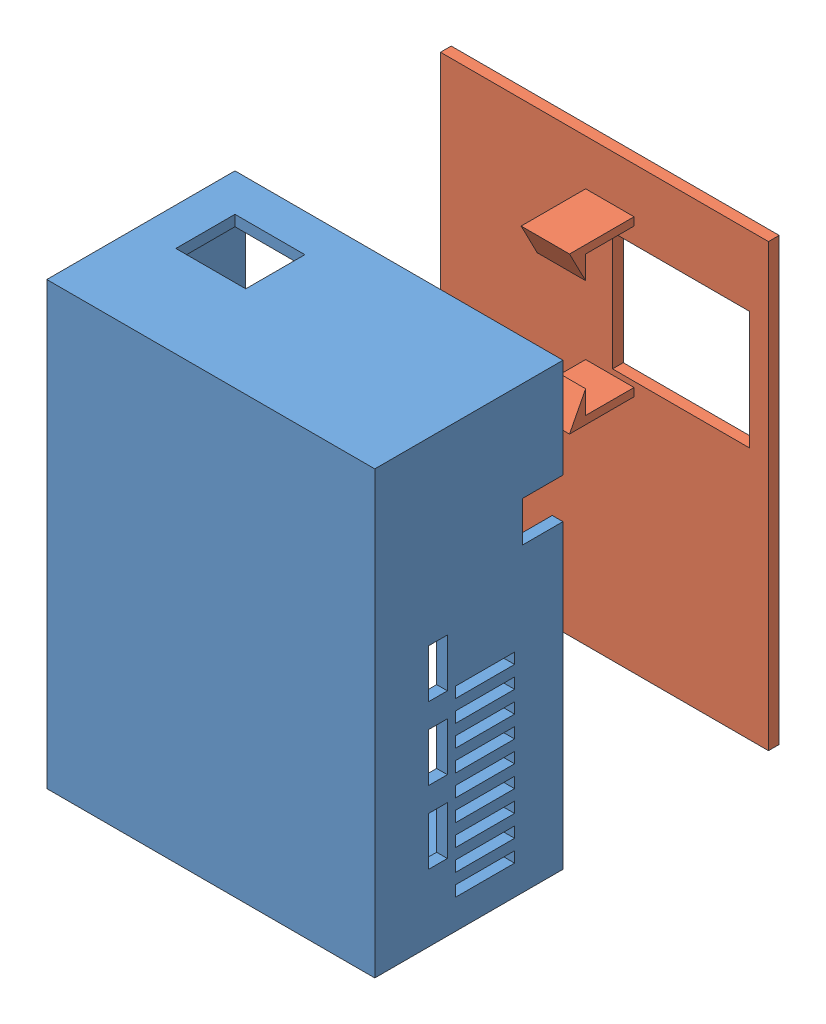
SolidWorks assembly Ensamblaje1.sldasm, configuration Predeterminado (file format 4700). Lengths in mm.
Overall size (74.38 82 76.21).
2 component instances, 2 part files, 2 mates.
Components (placement in the parent):
- caja-1: caja.SLDPRT [Predeterminado] at (33.7932 -13.6893 -17.5) size (74.38 82 35)
- TAPA-1: TAPA.SLDPRT [Predeterminado] at (7.4146 8.3292 -57.7137) x (0 1 0) z (0 0 1) size (82 61 15)
Mates (geometry in assembly coordinates):
- Coincidente2: coincident aligned: plane of caja-1 through (-31.0529 -39.0545 17.5) normal (0 -1 0); plane of TAPA-1 through (-31.0529 -39.0545 -55.7137) normal (0 -1 0)
- Coincidente3: coincident aligned: plane of caja-1 through (-31.0529 42.9455 17.5) normal (-1 0 0); plane of TAPA-1 through (-31.0529 -39.0545 -55.7137) normal (-1 0 0)
